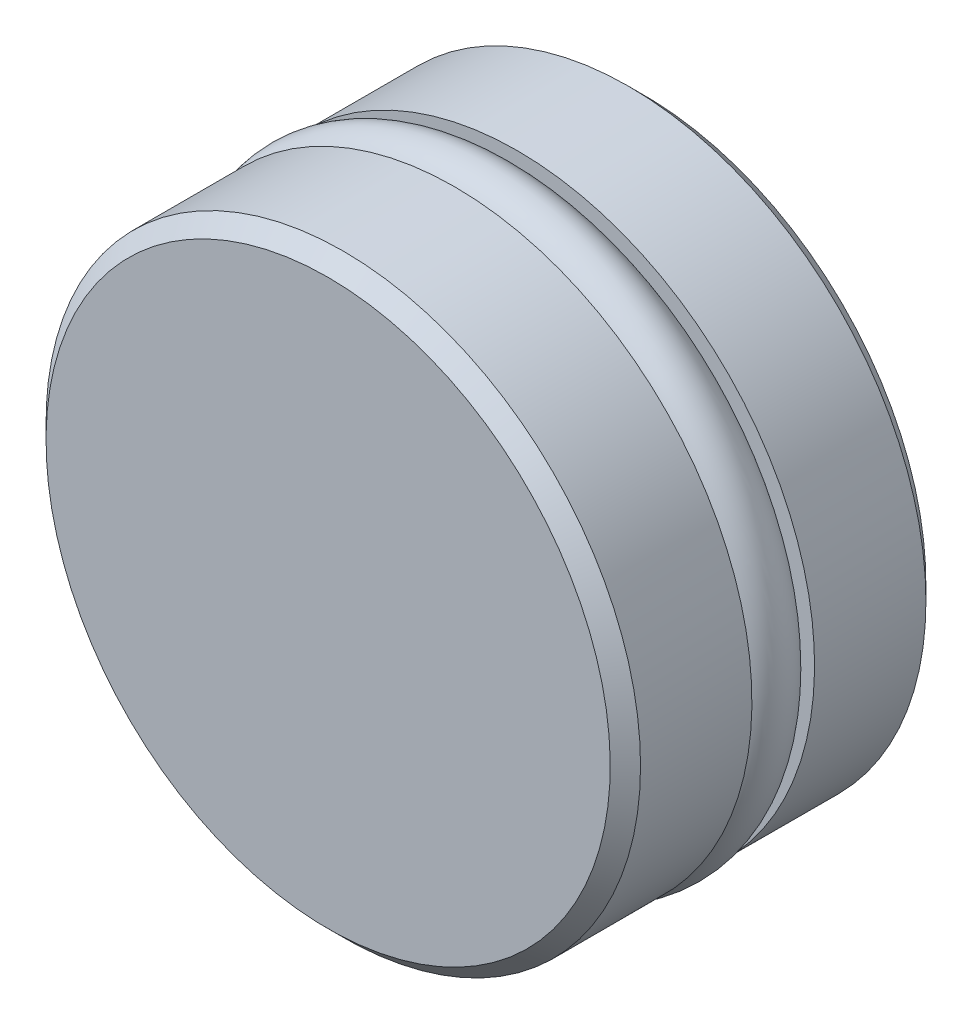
ISO-10303-21;
HEADER;
FILE_DESCRIPTION(('STEP AP214'),'2;1');
FILE_NAME('part.step','',(''),(''),'','','');
FILE_SCHEMA(('AUTOMOTIVE_DESIGN { 1 0 10303 214 1 1 1 1 }'));
ENDSEC;
DATA;
#1=APPLICATION_CONTEXT('core data for automotive mechanical design processes');
#2=APPLICATION_PROTOCOL_DEFINITION('international standard','automotive_design',2000,#1);
#3=PRODUCT_CONTEXT('',#1,'mechanical');
#4=PRODUCT('Part','Part','',(#3));
#5=PRODUCT_RELATED_PRODUCT_CATEGORY('part','',(#4));
#6=PRODUCT_DEFINITION_FORMATION('','',#4);
#7=PRODUCT_DEFINITION_CONTEXT('part definition',#1,'design');
#8=PRODUCT_DEFINITION('design','',#6,#7);
#9=PRODUCT_DEFINITION_SHAPE('','',#8);
#10=(LENGTH_UNIT() NAMED_UNIT(*) SI_UNIT(.MILLI.,.METRE.));
#11=(NAMED_UNIT(*) PLANE_ANGLE_UNIT() SI_UNIT($,.RADIAN.));
#12=(NAMED_UNIT(*) SI_UNIT($,.STERADIAN.) SOLID_ANGLE_UNIT());
#13=UNCERTAINTY_MEASURE_WITH_UNIT(LENGTH_MEASURE(1.E-05),#10,'distance_accuracy_value','');
#14=(GEOMETRIC_REPRESENTATION_CONTEXT(3) GLOBAL_UNCERTAINTY_ASSIGNED_CONTEXT((#13)) GLOBAL_UNIT_ASSIGNED_CONTEXT((#10,
#11,#12)) REPRESENTATION_CONTEXT('',''));
#15=CARTESIAN_POINT('',(0.,0.,0.));
#16=DIRECTION('',(0.,0.,1.));
#17=DIRECTION('',(1.,0.,0.));
#18=AXIS2_PLACEMENT_3D('',#15,#16,#17);
#19=CARTESIAN_POINT('',(0.,0.,9.59455189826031));
#20=DIRECTION('',(0.,0.,-1.));
#21=DIRECTION('',(-1.,0.,0.));
#22=AXIS2_PLACEMENT_3D('',#19,#20,#21);
#23=CONICAL_SURFACE('',#22,3.87095999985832,1.0274700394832);
#24=CARTESIAN_POINT('',(0.,0.,9.59455189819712));
#25=DIRECTION('',(0.,0.,-1.));
#26=DIRECTION('',(0.,1.,0.));
#27=AXIS2_PLACEMENT_3D('',#24,#25,#26);
#28=CIRCLE('',#27,3.87096);
#29=CARTESIAN_POINT('',(0.,3.87096,9.59455189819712));
#30=VERTEX_POINT('',#29);
#31=EDGE_CURVE('P0_E80',#30,#30,#28,.T.);
#32=ORIENTED_EDGE('',*,*,#31,.T.);
#33=EDGE_LOOP('',(#32));
#34=FACE_BOUND('',#33,.T.);
#35=CARTESIAN_POINT('',(5.6843418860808E-11,0.,11.932457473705));
#36=VERTEX_POINT('',#35);
#37=VERTEX_LOOP('',#36);
#38=FACE_BOUND('',#37,.T.);
#39=ADVANCED_FACE('P0_F16',(#34,#38),#23,.F.);
#40=CARTESIAN_POINT('',(0.,0.,4.79727594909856));
#41=DIRECTION('',(0.,0.,-1.));
#42=DIRECTION('',(0.,1.,0.));
#43=AXIS2_PLACEMENT_3D('',#40,#41,#42);
#44=CYLINDRICAL_SURFACE('',#43,3.87096);
#45=ORIENTED_EDGE('',*,*,#31,.F.);
#46=EDGE_LOOP('',(#45));
#47=FACE_BOUND('',#46,.T.);
#48=CARTESIAN_POINT('',(0.,0.,0.));
#49=DIRECTION('',(0.,0.,-1.));
#50=DIRECTION('',(0.,1.,0.));
#51=AXIS2_PLACEMENT_3D('',#48,#49,#50);
#52=CIRCLE('',#51,3.87096);
#53=CARTESIAN_POINT('',(0.,3.87096,0.));
#54=VERTEX_POINT('',#53);
#55=EDGE_CURVE('P0_E71',#54,#54,#52,.F.);
#56=ORIENTED_EDGE('',*,*,#55,.F.);
#57=EDGE_LOOP('',(#56));
#58=FACE_BOUND('',#57,.T.);
#59=ADVANCED_FACE('P0_F28',(#47,#58),#44,.F.);
#60=CARTESIAN_POINT('',(9.02843,0.,0.));
#61=DIRECTION('',(0.,0.,-1.));
#62=DIRECTION('',(-1.,0.,0.));
#63=AXIS2_PLACEMENT_3D('',#60,#61,#62);
#64=PLANE('',#63);
#65=ORIENTED_EDGE('',*,*,#55,.T.);
#66=EDGE_LOOP('',(#65));
#67=FACE_BOUND('',#66,.T.);
#68=CARTESIAN_POINT('',(0.,0.,0.));
#69=DIRECTION('',(0.,0.,1.));
#70=DIRECTION('',(0.,-1.,0.));
#71=AXIS2_PLACEMENT_3D('',#68,#69,#70);
#72=CIRCLE('',#71,14.1859);
#73=CARTESIAN_POINT('',(0.,-14.1859,0.));
#74=VERTEX_POINT('',#73);
#75=EDGE_CURVE('P0_E74',#74,#74,#72,.T.);
#76=ORIENTED_EDGE('',*,*,#75,.F.);
#77=EDGE_LOOP('',(#76));
#78=FACE_BOUND('',#77,.T.);
#79=ADVANCED_FACE('P0_F35',(#67,#78),#64,.T.);
#80=CARTESIAN_POINT('',(0.,0.,0.762));
#81=DIRECTION('',(0.,0.,1.));
#82=DIRECTION('',(0.,-1.,0.));
#83=AXIS2_PLACEMENT_3D('',#80,#81,#82);
#84=CONICAL_SURFACE('',#83,14.9479,0.785398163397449);
#85=ORIENTED_EDGE('',*,*,#75,.T.);
#86=EDGE_LOOP('',(#85));
#87=FACE_BOUND('',#86,.T.);
#88=CARTESIAN_POINT('',(0.,0.,0.762));
#89=DIRECTION('',(0.,0.,-1.));
#90=DIRECTION('',(0.,1.,0.));
#91=AXIS2_PLACEMENT_3D('',#88,#89,#90);
#92=CIRCLE('',#91,14.9479);
#93=CARTESIAN_POINT('',(0.,14.9479,0.761999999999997));
#94=VERTEX_POINT('',#93);
#95=EDGE_CURVE('P0_E75',#94,#94,#92,.F.);
#96=ORIENTED_EDGE('',*,*,#95,.F.);
#97=EDGE_LOOP('',(#96));
#98=FACE_BOUND('',#97,.T.);
#99=ADVANCED_FACE('P0_F52',(#87,#98),#84,.T.);
#100=CARTESIAN_POINT('',(0.,0.,3.556));
#101=DIRECTION('',(0.,0.,-1.));
#102=DIRECTION('',(0.,1.,0.));
#103=AXIS2_PLACEMENT_3D('',#100,#101,#102);
#104=CYLINDRICAL_SURFACE('',#103,14.9479);
#105=ORIENTED_EDGE('',*,*,#95,.T.);
#106=EDGE_LOOP('',(#105));
#107=FACE_BOUND('',#106,.T.);
#108=CARTESIAN_POINT('',(0.,0.,6.3627));
#109=DIRECTION('',(0.,0.,-1.));
#110=DIRECTION('',(0.,1.,0.));
#111=AXIS2_PLACEMENT_3D('',#108,#109,#110);
#112=CIRCLE('',#111,14.9479);
#113=CARTESIAN_POINT('',(0.,14.9479,6.3627));
#114=VERTEX_POINT('',#113);
#115=EDGE_CURVE('P0_E78',#114,#114,#112,.F.);
#116=ORIENTED_EDGE('',*,*,#115,.F.);
#117=EDGE_LOOP('',(#116));
#118=FACE_BOUND('',#117,.T.);
#119=ADVANCED_FACE('P0_F46',(#107,#118),#104,.T.);
#120=CARTESIAN_POINT('',(13.4747,0.,6.3627));
#121=DIRECTION('',(0.,0.,1.));
#122=DIRECTION('',(1.,0.,0.));
#123=AXIS2_PLACEMENT_3D('',#120,#121,#122);
#124=PLANE('',#123);
#125=CARTESIAN_POINT('',(0.,0.,6.3627));
#126=DIRECTION('',(0.,0.,1.));
#127=DIRECTION('',(1.,0.,0.));
#128=AXIS2_PLACEMENT_3D('',#125,#126,#127);
#129=CIRCLE('',#128,13.7894026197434);
#130=CARTESIAN_POINT('',(13.7894026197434,0.,6.3627));
#131=VERTEX_POINT('',#130);
#132=EDGE_CURVE('P0_E90',#131,#131,#129,.F.);
#133=ORIENTED_EDGE('',*,*,#132,.T.);
#134=EDGE_LOOP('',(#133));
#135=FACE_BOUND('',#134,.T.);
#136=ORIENTED_EDGE('',*,*,#115,.T.);
#137=EDGE_LOOP('',(#136));
#138=FACE_BOUND('',#137,.T.);
#139=ADVANCED_FACE('P0_F40',(#135,#138),#124,.T.);
#140=CARTESIAN_POINT('',(0.,0.,7.9375));
#141=DIRECTION('',(0.,0.,1.));
#142=DIRECTION('',(1.,0.,0.));
#143=AXIS2_PLACEMENT_3D('',#140,#141,#142);
#144=TOROIDAL_SURFACE('',#143,13.589,1.5875);
#145=ORIENTED_EDGE('',*,*,#132,.F.);
#146=EDGE_LOOP('',(#145));
#147=FACE_BOUND('',#146,.T.);
#148=CARTESIAN_POINT('',(0.,0.,6.3627));
#149=DIRECTION('',(0.,0.,-1.));
#150=DIRECTION('',(-1.,0.,0.));
#151=AXIS2_PLACEMENT_3D('',#148,#149,#150);
#152=CIRCLE('',#151,13.3885973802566);
#153=CARTESIAN_POINT('',(-13.3885973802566,0.,6.3627));
#154=VERTEX_POINT('',#153);
#155=EDGE_CURVE('P0_E97',#154,#154,#152,.F.);
#156=ORIENTED_EDGE('',*,*,#155,.F.);
#157=EDGE_LOOP('',(#156));
#158=FACE_BOUND('',#157,.T.);
#159=ADVANCED_FACE('P0_F30',(#147,#158),#144,.F.);
#160=CARTESIAN_POINT('',(0.,0.,0.));
#161=DIRECTION('',(0.,0.,-1.));
#162=DIRECTION('',(-1.,0.,0.));
#163=AXIS2_PLACEMENT_3D('',#160,#161,#162);
#164=CYLINDRICAL_SURFACE('',#163,12.0142);
#165=CARTESIAN_POINT('',(0.,0.,6.3627));
#166=DIRECTION('',(0.,0.,-1.));
#167=DIRECTION('',(-1.,0.,0.));
#168=AXIS2_PLACEMENT_3D('',#165,#166,#167);
#169=CIRCLE('',#168,12.0142);
#170=CARTESIAN_POINT('',(-12.0142,0.,6.3627));
#171=VERTEX_POINT('',#170);
#172=EDGE_CURVE('P0_E84',#171,#171,#169,.T.);
#173=ORIENTED_EDGE('',*,*,#172,.F.);
#174=EDGE_LOOP('',(#173));
#175=FACE_BOUND('',#174,.T.);
#176=CARTESIAN_POINT('',(0.,0.,9.5123));
#177=DIRECTION('',(0.,0.,-1.));
#178=DIRECTION('',(-1.,0.,0.));
#179=AXIS2_PLACEMENT_3D('',#176,#177,#178);
#180=CIRCLE('',#179,12.0142);
#181=CARTESIAN_POINT('',(-12.0142,0.,9.5123));
#182=VERTEX_POINT('',#181);
#183=EDGE_CURVE('P0_E19',#182,#182,#180,.F.);
#184=ORIENTED_EDGE('',*,*,#183,.F.);
#185=EDGE_LOOP('',(#184));
#186=FACE_BOUND('',#185,.T.);
#187=ADVANCED_FACE('P0_F39',(#175,#186),#164,.T.);
#188=CARTESIAN_POINT('',(13.4747,0.,6.3627));
#189=DIRECTION('',(0.,0.,1.));
#190=DIRECTION('',(1.,0.,0.));
#191=AXIS2_PLACEMENT_3D('',#188,#189,#190);
#192=PLANE('',#191);
#193=ORIENTED_EDGE('',*,*,#155,.T.);
#194=EDGE_LOOP('',(#193));
#195=FACE_BOUND('',#194,.T.);
#196=ORIENTED_EDGE('',*,*,#172,.T.);
#197=EDGE_LOOP('',(#196));
#198=FACE_BOUND('',#197,.T.);
#199=ADVANCED_FACE('P0_F44',(#195,#198),#192,.T.);
#200=CARTESIAN_POINT('',(13.4747,0.,9.5123));
#201=DIRECTION('',(0.,0.,-1.));
#202=DIRECTION('',(-1.,0.,0.));
#203=AXIS2_PLACEMENT_3D('',#200,#201,#202);
#204=PLANE('',#203);
#205=CARTESIAN_POINT('',(0.,0.,9.5123));
#206=DIRECTION('',(0.,0.,1.));
#207=DIRECTION('',(1.,0.,0.));
#208=AXIS2_PLACEMENT_3D('',#205,#206,#207);
#209=CIRCLE('',#208,13.3885973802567);
#210=CARTESIAN_POINT('',(13.3885973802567,0.,9.5123));
#211=VERTEX_POINT('',#210);
#212=EDGE_CURVE('P0_E126',#211,#211,#209,.F.);
#213=ORIENTED_EDGE('',*,*,#212,.T.);
#214=EDGE_LOOP('',(#213));
#215=FACE_BOUND('',#214,.T.);
#216=ORIENTED_EDGE('',*,*,#183,.T.);
#217=EDGE_LOOP('',(#216));
#218=FACE_BOUND('',#217,.T.);
#219=ADVANCED_FACE('P0_F123',(#215,#218),#204,.T.);
#220=CARTESIAN_POINT('',(0.,0.,9.5123));
#221=DIRECTION('',(0.,0.,-1.));
#222=DIRECTION('',(-1.,0.,0.));
#223=AXIS2_PLACEMENT_3D('',#220,#221,#222);
#224=CIRCLE('',#223,13.7894026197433);
#225=CARTESIAN_POINT('',(-13.7894026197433,0.,9.5123));
#226=VERTEX_POINT('',#225);
#227=EDGE_CURVE('P0_E93',#226,#226,#224,.F.);
#228=ORIENTED_EDGE('',*,*,#227,.F.);
#229=EDGE_LOOP('',(#228));
#230=FACE_BOUND('',#229,.T.);
#231=ORIENTED_EDGE('',*,*,#212,.F.);
#232=EDGE_LOOP('',(#231));
#233=FACE_BOUND('',#232,.T.);
#234=ADVANCED_FACE('P0_F43',(#230,#233),#144,.F.);
#235=CARTESIAN_POINT('',(7.09295,0.,15.875));
#236=DIRECTION('',(0.,0.,1.));
#237=DIRECTION('',(1.,0.,0.));
#238=AXIS2_PLACEMENT_3D('',#235,#236,#237);
#239=PLANE('',#238);
#240=CARTESIAN_POINT('',(0.,0.,15.875));
#241=DIRECTION('',(0.,0.,-1.));
#242=DIRECTION('',(0.,1.,0.));
#243=AXIS2_PLACEMENT_3D('',#240,#241,#242);
#244=CIRCLE('',#243,14.1859);
#245=CARTESIAN_POINT('',(0.,14.1859,15.875));
#246=VERTEX_POINT('',#245);
#247=EDGE_CURVE('P0_E11',#246,#246,#244,.F.);
#248=ORIENTED_EDGE('',*,*,#247,.T.);
#249=EDGE_LOOP('',(#248));
#250=FACE_BOUND('',#249,.T.);
#251=ADVANCED_FACE('P0_F122',(#250),#239,.T.);
#252=CARTESIAN_POINT('',(0.,0.,15.113));
#253=DIRECTION('',(0.,0.,-1.));
#254=DIRECTION('',(0.,1.,0.));
#255=AXIS2_PLACEMENT_3D('',#252,#253,#254);
#256=CONICAL_SURFACE('',#255,14.9479,0.78539816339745);
#257=CARTESIAN_POINT('',(0.,0.,15.113));
#258=DIRECTION('',(0.,0.,-1.));
#259=DIRECTION('',(1.,0.,0.));
#260=AXIS2_PLACEMENT_3D('',#257,#258,#259);
#261=CIRCLE('',#260,14.9479);
#262=CARTESIAN_POINT('',(14.9479,0.,15.113));
#263=VERTEX_POINT('',#262);
#264=EDGE_CURVE('P0_E23',#263,#263,#261,.F.);
#265=ORIENTED_EDGE('',*,*,#264,.T.);
#266=EDGE_LOOP('',(#265));
#267=FACE_BOUND('',#266,.T.);
#268=ORIENTED_EDGE('',*,*,#247,.F.);
#269=EDGE_LOOP('',(#268));
#270=FACE_BOUND('',#269,.T.);
#271=ADVANCED_FACE('P0_F117',(#267,#270),#256,.T.);
#272=CARTESIAN_POINT('',(0.,0.,12.319));
#273=DIRECTION('',(0.,0.,-1.));
#274=DIRECTION('',(0.,1.,0.));
#275=AXIS2_PLACEMENT_3D('',#272,#273,#274);
#276=CYLINDRICAL_SURFACE('',#275,14.9479);
#277=CARTESIAN_POINT('',(0.,0.,9.5123));
#278=DIRECTION('',(0.,0.,-1.));
#279=DIRECTION('',(0.,1.,0.));
#280=AXIS2_PLACEMENT_3D('',#277,#278,#279);
#281=CIRCLE('',#280,14.9479);
#282=CARTESIAN_POINT('',(0.,14.9479,9.5123));
#283=VERTEX_POINT('',#282);
#284=EDGE_CURVE('P0_E102',#283,#283,#281,.F.);
#285=ORIENTED_EDGE('',*,*,#284,.T.);
#286=EDGE_LOOP('',(#285));
#287=FACE_BOUND('',#286,.T.);
#288=ORIENTED_EDGE('',*,*,#264,.F.);
#289=EDGE_LOOP('',(#288));
#290=FACE_BOUND('',#289,.T.);
#291=ADVANCED_FACE('P0_F109',(#287,#290),#276,.T.);
#292=CARTESIAN_POINT('',(13.4747,0.,9.5123));
#293=DIRECTION('',(0.,0.,-1.));
#294=DIRECTION('',(-1.,0.,0.));
#295=AXIS2_PLACEMENT_3D('',#292,#293,#294);
#296=PLANE('',#295);
#297=ORIENTED_EDGE('',*,*,#227,.T.);
#298=EDGE_LOOP('',(#297));
#299=FACE_BOUND('',#298,.T.);
#300=ORIENTED_EDGE('',*,*,#284,.F.);
#301=EDGE_LOOP('',(#300));
#302=FACE_BOUND('',#301,.T.);
#303=ADVANCED_FACE('P0_F58',(#299,#302),#296,.T.);
#304=CLOSED_SHELL('',(#39,#59,#79,#99,#119,#139,#159,#187,#199,#219,#234,#251,#271,#291,#303));
#305=MANIFOLD_SOLID_BREP('P0_B1',#304);
#306=CARTESIAN_POINT('',(0.,0.,7.9375));
#307=DIRECTION('',(0.,0.,-1.));
#308=DIRECTION('',(-1.,0.,0.));
#309=AXIS2_PLACEMENT_3D('',#306,#307,#308);
#310=TOROIDAL_SURFACE('',#309,13.589,1.5875);
#311=CARTESIAN_POINT('',(-15.1765,0.,7.9375));
#312=VERTEX_POINT('',#311);
#313=VERTEX_LOOP('',#312);
#314=FACE_BOUND('',#313,.T.);
#315=ADVANCED_FACE('P1_F11',(#314),#310,.T.);
#316=CLOSED_SHELL('',(#315));
#317=MANIFOLD_SOLID_BREP('P1_B1',#316);
#318=ADVANCED_BREP_SHAPE_REPRESENTATION('',(#18,#305,#317),#14);
#319=SHAPE_DEFINITION_REPRESENTATION(#9,#318);
ENDSEC;
END-ISO-10303-21;
